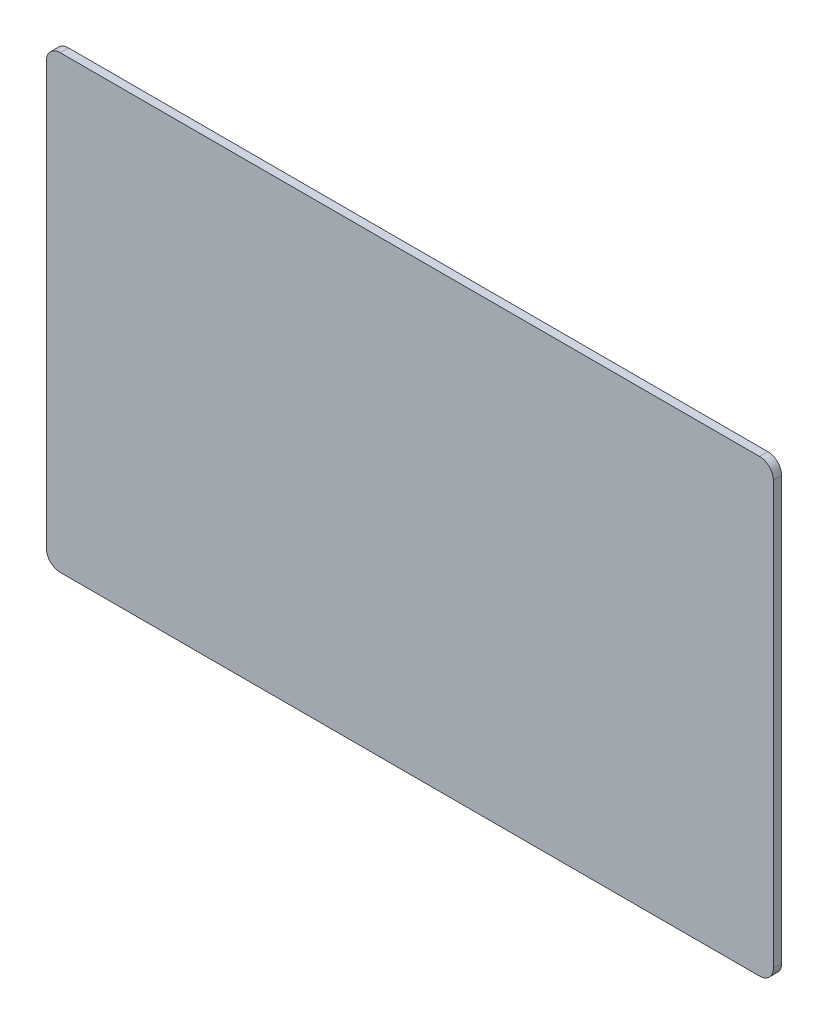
ISO-10303-21;
HEADER;
FILE_DESCRIPTION(('STEP AP214'),'2;1');
FILE_NAME('part.step','',(''),(''),'','','');
FILE_SCHEMA(('AUTOMOTIVE_DESIGN { 1 0 10303 214 1 1 1 1 }'));
ENDSEC;
DATA;
#1=APPLICATION_CONTEXT('core data for automotive mechanical design processes');
#2=APPLICATION_PROTOCOL_DEFINITION('international standard','automotive_design',2000,#1);
#3=PRODUCT_CONTEXT('',#1,'mechanical');
#4=PRODUCT('Part','Part','',(#3));
#5=PRODUCT_RELATED_PRODUCT_CATEGORY('part','',(#4));
#6=PRODUCT_DEFINITION_FORMATION('','',#4);
#7=PRODUCT_DEFINITION_CONTEXT('part definition',#1,'design');
#8=PRODUCT_DEFINITION('design','',#6,#7);
#9=PRODUCT_DEFINITION_SHAPE('','',#8);
#10=(LENGTH_UNIT() NAMED_UNIT(*) SI_UNIT(.MILLI.,.METRE.));
#11=(NAMED_UNIT(*) PLANE_ANGLE_UNIT() SI_UNIT($,.RADIAN.));
#12=(NAMED_UNIT(*) SI_UNIT($,.STERADIAN.) SOLID_ANGLE_UNIT());
#13=UNCERTAINTY_MEASURE_WITH_UNIT(LENGTH_MEASURE(1.E-05),#10,'distance_accuracy_value','');
#14=(GEOMETRIC_REPRESENTATION_CONTEXT(3) GLOBAL_UNCERTAINTY_ASSIGNED_CONTEXT((#13)) GLOBAL_UNIT_ASSIGNED_CONTEXT((#10,
#11,#12)) REPRESENTATION_CONTEXT('',''));
#15=CARTESIAN_POINT('',(0.,0.,0.));
#16=DIRECTION('',(0.,0.,1.));
#17=DIRECTION('',(1.,0.,0.));
#18=AXIS2_PLACEMENT_3D('',#15,#16,#17);
#19=CARTESIAN_POINT('',(0.,0.,0.));
#20=DIRECTION('',(0.,0.,-1.));
#21=DIRECTION('',(-1.,0.,0.));
#22=AXIS2_PLACEMENT_3D('',#19,#20,#21);
#23=PLANE('',#22);
#24=DIRECTION('',(-1.,0.,0.));
#25=VECTOR('',#24,1.);
#26=CARTESIAN_POINT('',(-52.5,32.5,0.));
#27=LINE('',#26,#25);
#28=CARTESIAN_POINT('',(50.5,32.5,0.));
#29=VERTEX_POINT('',#28);
#30=CARTESIAN_POINT('',(-50.5,32.5,0.));
#31=VERTEX_POINT('',#30);
#32=EDGE_CURVE('E175',#29,#31,#27,.T.);
#33=ORIENTED_EDGE('',*,*,#32,.F.);
#34=CARTESIAN_POINT('',(50.5,30.5,0.));
#35=DIRECTION('',(0.,0.,-1.));
#36=DIRECTION('',(-1.,0.,0.));
#37=AXIS2_PLACEMENT_3D('',#34,#35,#36);
#38=CIRCLE('',#37,2.);
#39=CARTESIAN_POINT('',(52.5,30.5,0.));
#40=VERTEX_POINT('',#39);
#41=EDGE_CURVE('E212',#29,#40,#38,.T.);
#42=ORIENTED_EDGE('',*,*,#41,.T.);
#43=DIRECTION('',(0.,1.,0.));
#44=VECTOR('',#43,1.);
#45=CARTESIAN_POINT('',(52.5,-32.5,0.));
#46=LINE('',#45,#44);
#47=CARTESIAN_POINT('',(52.5,-30.5,0.));
#48=VERTEX_POINT('',#47);
#49=EDGE_CURVE('E172',#48,#40,#46,.T.);
#50=ORIENTED_EDGE('',*,*,#49,.F.);
#51=CARTESIAN_POINT('',(50.5,-30.5,0.));
#52=DIRECTION('',(0.,0.,-1.));
#53=DIRECTION('',(-1.,0.,0.));
#54=AXIS2_PLACEMENT_3D('',#51,#52,#53);
#55=CIRCLE('',#54,2.);
#56=CARTESIAN_POINT('',(50.5,-32.5,0.));
#57=VERTEX_POINT('',#56);
#58=EDGE_CURVE('E206',#48,#57,#55,.T.);
#59=ORIENTED_EDGE('',*,*,#58,.T.);
#60=DIRECTION('',(1.,0.,0.));
#61=VECTOR('',#60,1.);
#62=CARTESIAN_POINT('',(-52.5,-32.5,0.));
#63=LINE('',#62,#61);
#64=CARTESIAN_POINT('',(-50.5,-32.5,0.));
#65=VERTEX_POINT('',#64);
#66=EDGE_CURVE('E185',#65,#57,#63,.T.);
#67=ORIENTED_EDGE('',*,*,#66,.F.);
#68=CARTESIAN_POINT('',(-50.5,-30.5,0.));
#69=DIRECTION('',(0.,0.,-1.));
#70=DIRECTION('',(-1.,0.,0.));
#71=AXIS2_PLACEMENT_3D('',#68,#69,#70);
#72=CIRCLE('',#71,2.);
#73=CARTESIAN_POINT('',(-52.5,-30.5,0.));
#74=VERTEX_POINT('',#73);
#75=EDGE_CURVE('E208',#65,#74,#72,.T.);
#76=ORIENTED_EDGE('',*,*,#75,.T.);
#77=DIRECTION('',(0.,-1.,0.));
#78=VECTOR('',#77,1.);
#79=CARTESIAN_POINT('',(-52.5,-32.5,0.));
#80=LINE('',#79,#78);
#81=CARTESIAN_POINT('',(-52.5,30.5,0.));
#82=VERTEX_POINT('',#81);
#83=EDGE_CURVE('E197',#82,#74,#80,.T.);
#84=ORIENTED_EDGE('',*,*,#83,.F.);
#85=CARTESIAN_POINT('',(-50.5,30.5,0.));
#86=DIRECTION('',(0.,0.,-1.));
#87=DIRECTION('',(-1.,0.,0.));
#88=AXIS2_PLACEMENT_3D('',#85,#86,#87);
#89=CIRCLE('',#88,2.);
#90=EDGE_CURVE('E210',#82,#31,#89,.T.);
#91=ORIENTED_EDGE('',*,*,#90,.T.);
#92=EDGE_LOOP('',(#33,#42,#50,#59,#67,#76,#84,#91));
#93=FACE_BOUND('',#92,.T.);
#94=DIRECTION('',(-1.,0.,0.));
#95=VECTOR('',#94,1.);
#96=CARTESIAN_POINT('',(0.,21.5,0.));
#97=LINE('',#96,#95);
#98=CARTESIAN_POINT('',(25.5,21.5,0.));
#99=VERTEX_POINT('',#98);
#100=CARTESIAN_POINT('',(-25.5,21.5,0.));
#101=VERTEX_POINT('',#100);
#102=EDGE_CURVE('E245',#99,#101,#97,.T.);
#103=ORIENTED_EDGE('',*,*,#102,.T.);
#104=DIRECTION('',(0.,-1.,0.));
#105=VECTOR('',#104,1.);
#106=CARTESIAN_POINT('',(-25.5,0.,0.));
#107=LINE('',#106,#105);
#108=CARTESIAN_POINT('',(-25.5,-10.5,0.));
#109=VERTEX_POINT('',#108);
#110=EDGE_CURVE('E249',#101,#109,#107,.T.);
#111=ORIENTED_EDGE('',*,*,#110,.T.);
#112=DIRECTION('',(1.,0.,0.));
#113=VECTOR('',#112,1.);
#114=CARTESIAN_POINT('',(0.,-10.5,0.));
#115=LINE('',#114,#113);
#116=CARTESIAN_POINT('',(25.5,-10.5,0.));
#117=VERTEX_POINT('',#116);
#118=EDGE_CURVE('E237',#109,#117,#115,.T.);
#119=ORIENTED_EDGE('',*,*,#118,.T.);
#120=DIRECTION('',(0.,1.,0.));
#121=VECTOR('',#120,1.);
#122=CARTESIAN_POINT('',(25.5,0.,0.));
#123=LINE('',#122,#121);
#124=EDGE_CURVE('E241',#117,#99,#123,.T.);
#125=ORIENTED_EDGE('',*,*,#124,.T.);
#126=EDGE_LOOP('',(#103,#111,#119,#125));
#127=FACE_BOUND('',#126,.T.);
#128=DIRECTION('',(1.,0.,0.));
#129=VECTOR('',#128,1.);
#130=CARTESIAN_POINT('',(5.49999999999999,-22.6,0.));
#131=LINE('',#130,#129);
#132=CARTESIAN_POINT('',(-5.50000000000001,-22.6,0.));
#133=VERTEX_POINT('',#132);
#134=CARTESIAN_POINT('',(5.49999999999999,-22.6,0.));
#135=VERTEX_POINT('',#134);
#136=EDGE_CURVE('E294',#133,#135,#131,.T.);
#137=ORIENTED_EDGE('',*,*,#136,.F.);
#138=DIRECTION('',(0.,1.,0.));
#139=VECTOR('',#138,1.);
#140=CARTESIAN_POINT('',(-5.50000000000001,-27.8,0.));
#141=LINE('',#140,#139);
#142=CARTESIAN_POINT('',(-5.50000000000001,-27.8,0.));
#143=VERTEX_POINT('',#142);
#144=EDGE_CURVE('E170',#143,#133,#141,.T.);
#145=ORIENTED_EDGE('',*,*,#144,.F.);
#146=DIRECTION('',(-1.,0.,0.));
#147=VECTOR('',#146,1.);
#148=CARTESIAN_POINT('',(5.49999999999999,-27.8,0.));
#149=LINE('',#148,#147);
#150=CARTESIAN_POINT('',(5.49999999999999,-27.8,0.));
#151=VERTEX_POINT('',#150);
#152=EDGE_CURVE('E166',#151,#143,#149,.T.);
#153=ORIENTED_EDGE('',*,*,#152,.F.);
#154=DIRECTION('',(0.,-1.,0.));
#155=VECTOR('',#154,1.);
#156=CARTESIAN_POINT('',(5.49999999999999,-27.8,0.));
#157=LINE('',#156,#155);
#158=EDGE_CURVE('E297',#135,#151,#157,.T.);
#159=ORIENTED_EDGE('',*,*,#158,.F.);
#160=EDGE_LOOP('',(#137,#145,#153,#159));
#161=FACE_BOUND('',#160,.T.);
#162=DIRECTION('',(-1.,0.,0.));
#163=VECTOR('',#162,1.);
#164=CARTESIAN_POINT('',(0.,21.5,0.));
#165=LINE('',#164,#163);
#166=CARTESIAN_POINT('',(45.2,21.5,0.));
#167=VERTEX_POINT('',#166);
#168=CARTESIAN_POINT('',(40.2,21.5,0.));
#169=VERTEX_POINT('',#168);
#170=EDGE_CURVE('E47',#167,#169,#165,.T.);
#171=ORIENTED_EDGE('',*,*,#170,.T.);
#172=DIRECTION('',(0.,-1.,0.));
#173=VECTOR('',#172,1.);
#174=CARTESIAN_POINT('',(40.2,0.,0.));
#175=LINE('',#174,#173);
#176=CARTESIAN_POINT('',(40.2,8.5,0.));
#177=VERTEX_POINT('',#176);
#178=EDGE_CURVE('E11',#169,#177,#175,.T.);
#179=ORIENTED_EDGE('',*,*,#178,.T.);
#180=DIRECTION('',(1.,0.,0.));
#181=VECTOR('',#180,1.);
#182=CARTESIAN_POINT('',(0.,8.50000000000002,0.));
#183=LINE('',#182,#181);
#184=CARTESIAN_POINT('',(45.2,8.5,0.));
#185=VERTEX_POINT('',#184);
#186=EDGE_CURVE('E252',#177,#185,#183,.T.);
#187=ORIENTED_EDGE('',*,*,#186,.T.);
#188=DIRECTION('',(0.,1.,0.));
#189=VECTOR('',#188,1.);
#190=CARTESIAN_POINT('',(45.2,0.,0.));
#191=LINE('',#190,#189);
#192=EDGE_CURVE('E256',#185,#167,#191,.T.);
#193=ORIENTED_EDGE('',*,*,#192,.T.);
#194=EDGE_LOOP('',(#171,#179,#187,#193));
#195=FACE_BOUND('',#194,.T.);
#196=ADVANCED_FACE('F38',(#93,#127,#161,#195),#23,.T.);
#197=ORIENTED_EDGE('',*,*,#178,.F.);
#198=ORIENTED_EDGE('',*,*,#170,.F.);
#199=ORIENTED_EDGE('',*,*,#192,.F.);
#200=ORIENTED_EDGE('',*,*,#186,.F.);
#201=EDGE_LOOP('',(#197,#198,#199,#200));
#202=FACE_BOUND('',#201,.T.);
#203=ADVANCED_FACE('F262',(#202),#23,.T.);
#204=CARTESIAN_POINT('',(52.5,-32.5,1.2));
#205=DIRECTION('',(-1.,0.,0.));
#206=DIRECTION('',(0.,0.,1.));
#207=AXIS2_PLACEMENT_3D('',#204,#205,#206);
#208=PLANE('',#207);
#209=ORIENTED_EDGE('',*,*,#49,.T.);
#210=DIRECTION('',(0.,0.,-1.));
#211=VECTOR('',#210,1.);
#212=CARTESIAN_POINT('',(52.5,30.5,1.2));
#213=LINE('',#212,#211);
#214=CARTESIAN_POINT('',(52.5,30.5,1.2));
#215=VERTEX_POINT('',#214);
#216=EDGE_CURVE('E217',#40,#215,#213,.F.);
#217=ORIENTED_EDGE('',*,*,#216,.T.);
#218=DIRECTION('',(0.,1.,0.));
#219=VECTOR('',#218,1.);
#220=CARTESIAN_POINT('',(52.5,-32.5,1.2));
#221=LINE('',#220,#219);
#222=CARTESIAN_POINT('',(52.5,-30.5,1.2));
#223=VERTEX_POINT('',#222);
#224=EDGE_CURVE('E181',#223,#215,#221,.T.);
#225=ORIENTED_EDGE('',*,*,#224,.F.);
#226=DIRECTION('',(0.,0.,-1.));
#227=VECTOR('',#226,1.);
#228=CARTESIAN_POINT('',(52.5,-30.5,1.2));
#229=LINE('',#228,#227);
#230=EDGE_CURVE('E214',#223,#48,#229,.T.);
#231=ORIENTED_EDGE('',*,*,#230,.T.);
#232=EDGE_LOOP('',(#209,#217,#225,#231));
#233=FACE_BOUND('',#232,.T.);
#234=ADVANCED_FACE('F264',(#233),#208,.F.);
#235=CARTESIAN_POINT('',(-52.5,32.5,1.2));
#236=DIRECTION('',(0.,-1.,0.));
#237=DIRECTION('',(0.,0.,-1.));
#238=AXIS2_PLACEMENT_3D('',#235,#236,#237);
#239=PLANE('',#238);
#240=DIRECTION('',(-1.,0.,0.));
#241=VECTOR('',#240,1.);
#242=CARTESIAN_POINT('',(-52.5,32.5,1.2));
#243=LINE('',#242,#241);
#244=CARTESIAN_POINT('',(50.5,32.5,1.2));
#245=VERTEX_POINT('',#244);
#246=CARTESIAN_POINT('',(-50.5,32.5,1.2));
#247=VERTEX_POINT('',#246);
#248=EDGE_CURVE('E184',#245,#247,#243,.T.);
#249=ORIENTED_EDGE('',*,*,#248,.F.);
#250=DIRECTION('',(0.,0.,-1.));
#251=VECTOR('',#250,1.);
#252=CARTESIAN_POINT('',(50.5,32.5,1.2));
#253=LINE('',#252,#251);
#254=EDGE_CURVE('E203',#245,#29,#253,.T.);
#255=ORIENTED_EDGE('',*,*,#254,.T.);
#256=ORIENTED_EDGE('',*,*,#32,.T.);
#257=DIRECTION('',(0.,0.,-1.));
#258=VECTOR('',#257,1.);
#259=CARTESIAN_POINT('',(-50.5,32.5,1.2));
#260=LINE('',#259,#258);
#261=EDGE_CURVE('E193',#31,#247,#260,.F.);
#262=ORIENTED_EDGE('',*,*,#261,.T.);
#263=EDGE_LOOP('',(#249,#255,#256,#262));
#264=FACE_BOUND('',#263,.T.);
#265=ADVANCED_FACE('F271',(#264),#239,.F.);
#266=CARTESIAN_POINT('',(-52.5,-32.5,1.2));
#267=DIRECTION('',(1.,0.,0.));
#268=DIRECTION('',(0.,0.,-1.));
#269=AXIS2_PLACEMENT_3D('',#266,#267,#268);
#270=PLANE('',#269);
#271=DIRECTION('',(0.,-1.,0.));
#272=VECTOR('',#271,1.);
#273=CARTESIAN_POINT('',(-52.5,-32.5,1.2));
#274=LINE('',#273,#272);
#275=CARTESIAN_POINT('',(-52.5,30.5,1.2));
#276=VERTEX_POINT('',#275);
#277=CARTESIAN_POINT('',(-52.5,-30.5,1.2));
#278=VERTEX_POINT('',#277);
#279=EDGE_CURVE('E188',#276,#278,#274,.T.);
#280=ORIENTED_EDGE('',*,*,#279,.F.);
#281=DIRECTION('',(0.,0.,-1.));
#282=VECTOR('',#281,1.);
#283=CARTESIAN_POINT('',(-52.5,30.5,1.2));
#284=LINE('',#283,#282);
#285=EDGE_CURVE('E229',#276,#82,#284,.T.);
#286=ORIENTED_EDGE('',*,*,#285,.T.);
#287=ORIENTED_EDGE('',*,*,#83,.T.);
#288=DIRECTION('',(0.,0.,-1.));
#289=VECTOR('',#288,1.);
#290=CARTESIAN_POINT('',(-52.5,-30.5,1.2));
#291=LINE('',#290,#289);
#292=EDGE_CURVE('E227',#74,#278,#291,.F.);
#293=ORIENTED_EDGE('',*,*,#292,.T.);
#294=EDGE_LOOP('',(#280,#286,#287,#293));
#295=FACE_BOUND('',#294,.T.);
#296=ADVANCED_FACE('F350',(#295),#270,.F.);
#297=CARTESIAN_POINT('',(-52.5,-32.5,1.2));
#298=DIRECTION('',(0.,1.,0.));
#299=DIRECTION('',(0.,0.,1.));
#300=AXIS2_PLACEMENT_3D('',#297,#298,#299);
#301=PLANE('',#300);
#302=DIRECTION('',(1.,0.,0.));
#303=VECTOR('',#302,1.);
#304=CARTESIAN_POINT('',(-52.5,-32.5,1.2));
#305=LINE('',#304,#303);
#306=CARTESIAN_POINT('',(-50.5,-32.5,1.2));
#307=VERTEX_POINT('',#306);
#308=CARTESIAN_POINT('',(50.5,-32.5,1.2));
#309=VERTEX_POINT('',#308);
#310=EDGE_CURVE('E191',#307,#309,#305,.T.);
#311=ORIENTED_EDGE('',*,*,#310,.F.);
#312=DIRECTION('',(0.,0.,-1.));
#313=VECTOR('',#312,1.);
#314=CARTESIAN_POINT('',(-50.5,-32.5,1.2));
#315=LINE('',#314,#313);
#316=EDGE_CURVE('E234',#307,#65,#315,.T.);
#317=ORIENTED_EDGE('',*,*,#316,.T.);
#318=ORIENTED_EDGE('',*,*,#66,.T.);
#319=DIRECTION('',(0.,0.,-1.));
#320=VECTOR('',#319,1.);
#321=CARTESIAN_POINT('',(50.5,-32.5,1.2));
#322=LINE('',#321,#320);
#323=EDGE_CURVE('E232',#57,#309,#322,.F.);
#324=ORIENTED_EDGE('',*,*,#323,.T.);
#325=EDGE_LOOP('',(#311,#317,#318,#324));
#326=FACE_BOUND('',#325,.T.);
#327=ADVANCED_FACE('F288',(#326),#301,.F.);
#328=CARTESIAN_POINT('',(0.,0.,1.2));
#329=DIRECTION('',(0.,0.,-1.));
#330=DIRECTION('',(-1.,0.,0.));
#331=AXIS2_PLACEMENT_3D('',#328,#329,#330);
#332=PLANE('',#331);
#333=ORIENTED_EDGE('',*,*,#224,.T.);
#334=CARTESIAN_POINT('',(50.5,30.5,1.2));
#335=DIRECTION('',(0.,0.,-1.));
#336=DIRECTION('',(-1.,0.,0.));
#337=AXIS2_PLACEMENT_3D('',#334,#335,#336);
#338=CIRCLE('',#337,2.);
#339=EDGE_CURVE('E225',#215,#245,#338,.F.);
#340=ORIENTED_EDGE('',*,*,#339,.T.);
#341=ORIENTED_EDGE('',*,*,#248,.T.);
#342=CARTESIAN_POINT('',(-50.5,30.5,1.2));
#343=DIRECTION('',(0.,0.,-1.));
#344=DIRECTION('',(-1.,0.,0.));
#345=AXIS2_PLACEMENT_3D('',#342,#343,#344);
#346=CIRCLE('',#345,2.);
#347=EDGE_CURVE('E223',#247,#276,#346,.F.);
#348=ORIENTED_EDGE('',*,*,#347,.T.);
#349=ORIENTED_EDGE('',*,*,#279,.T.);
#350=CARTESIAN_POINT('',(-50.5,-30.5,1.2));
#351=DIRECTION('',(0.,0.,-1.));
#352=DIRECTION('',(-1.,0.,0.));
#353=AXIS2_PLACEMENT_3D('',#350,#351,#352);
#354=CIRCLE('',#353,2.);
#355=EDGE_CURVE('E221',#278,#307,#354,.F.);
#356=ORIENTED_EDGE('',*,*,#355,.T.);
#357=ORIENTED_EDGE('',*,*,#310,.T.);
#358=CARTESIAN_POINT('',(50.5,-30.5,1.2));
#359=DIRECTION('',(0.,0.,-1.));
#360=DIRECTION('',(-1.,0.,0.));
#361=AXIS2_PLACEMENT_3D('',#358,#359,#360);
#362=CIRCLE('',#361,2.);
#363=EDGE_CURVE('E219',#309,#223,#362,.F.);
#364=ORIENTED_EDGE('',*,*,#363,.T.);
#365=EDGE_LOOP('',(#333,#340,#341,#348,#349,#356,#357,#364));
#366=FACE_BOUND('',#365,.T.);
#367=ADVANCED_FACE('F279',(#366),#332,.F.);
#368=ORIENTED_EDGE('',*,*,#110,.F.);
#369=ORIENTED_EDGE('',*,*,#102,.F.);
#370=ORIENTED_EDGE('',*,*,#124,.F.);
#371=ORIENTED_EDGE('',*,*,#118,.F.);
#372=EDGE_LOOP('',(#368,#369,#370,#371));
#373=FACE_BOUND('',#372,.T.);
#374=ADVANCED_FACE('F266',(#373),#23,.T.);
#375=CARTESIAN_POINT('',(50.5,30.5,1.2));
#376=DIRECTION('',(0.,0.,-1.));
#377=DIRECTION('',(-1.,0.,0.));
#378=AXIS2_PLACEMENT_3D('',#375,#376,#377);
#379=CYLINDRICAL_SURFACE('',#378,2.);
#380=ORIENTED_EDGE('',*,*,#339,.F.);
#381=ORIENTED_EDGE('',*,*,#216,.F.);
#382=ORIENTED_EDGE('',*,*,#41,.F.);
#383=ORIENTED_EDGE('',*,*,#254,.F.);
#384=EDGE_LOOP('',(#380,#381,#382,#383));
#385=FACE_BOUND('',#384,.T.);
#386=ADVANCED_FACE('F278',(#385),#379,.T.);
#387=CARTESIAN_POINT('',(-50.5,30.5,1.2));
#388=DIRECTION('',(0.,0.,-1.));
#389=DIRECTION('',(-1.,0.,0.));
#390=AXIS2_PLACEMENT_3D('',#387,#388,#389);
#391=CYLINDRICAL_SURFACE('',#390,2.);
#392=ORIENTED_EDGE('',*,*,#347,.F.);
#393=ORIENTED_EDGE('',*,*,#261,.F.);
#394=ORIENTED_EDGE('',*,*,#90,.F.);
#395=ORIENTED_EDGE('',*,*,#285,.F.);
#396=EDGE_LOOP('',(#392,#393,#394,#395));
#397=FACE_BOUND('',#396,.T.);
#398=ADVANCED_FACE('F285',(#397),#391,.T.);
#399=CARTESIAN_POINT('',(-50.5,-30.5,1.2));
#400=DIRECTION('',(0.,0.,-1.));
#401=DIRECTION('',(-1.,0.,0.));
#402=AXIS2_PLACEMENT_3D('',#399,#400,#401);
#403=CYLINDRICAL_SURFACE('',#402,2.);
#404=ORIENTED_EDGE('',*,*,#355,.F.);
#405=ORIENTED_EDGE('',*,*,#292,.F.);
#406=ORIENTED_EDGE('',*,*,#75,.F.);
#407=ORIENTED_EDGE('',*,*,#316,.F.);
#408=EDGE_LOOP('',(#404,#405,#406,#407));
#409=FACE_BOUND('',#408,.T.);
#410=ADVANCED_FACE('F325',(#409),#403,.T.);
#411=CARTESIAN_POINT('',(50.5,-30.5,1.2));
#412=DIRECTION('',(0.,0.,-1.));
#413=DIRECTION('',(-1.,0.,0.));
#414=AXIS2_PLACEMENT_3D('',#411,#412,#413);
#415=CYLINDRICAL_SURFACE('',#414,2.);
#416=ORIENTED_EDGE('',*,*,#363,.F.);
#417=ORIENTED_EDGE('',*,*,#323,.F.);
#418=ORIENTED_EDGE('',*,*,#58,.F.);
#419=ORIENTED_EDGE('',*,*,#230,.F.);
#420=EDGE_LOOP('',(#416,#417,#418,#419));
#421=FACE_BOUND('',#420,.T.);
#422=ADVANCED_FACE('F40',(#421),#415,.T.);
#423=CARTESIAN_POINT('',(-5.50000000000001,-27.8,-1.6));
#424=DIRECTION('',(1.,0.,0.));
#425=DIRECTION('',(0.,0.,-1.));
#426=AXIS2_PLACEMENT_3D('',#423,#424,#425);
#427=PLANE('',#426);
#428=ORIENTED_EDGE('',*,*,#144,.T.);
#429=DIRECTION('',(0.,0.,1.));
#430=VECTOR('',#429,1.);
#431=CARTESIAN_POINT('',(-5.50000000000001,-22.6,-1.6));
#432=LINE('',#431,#430);
#433=CARTESIAN_POINT('',(-5.50000000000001,-22.6,-1.6));
#434=VERTEX_POINT('',#433);
#435=EDGE_CURVE('E150',#434,#133,#432,.T.);
#436=ORIENTED_EDGE('',*,*,#435,.F.);
#437=DIRECTION('',(0.,1.,0.));
#438=VECTOR('',#437,1.);
#439=CARTESIAN_POINT('',(-5.50000000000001,-27.8,-1.6));
#440=LINE('',#439,#438);
#441=CARTESIAN_POINT('',(-5.50000000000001,-27.8,-1.6));
#442=VERTEX_POINT('',#441);
#443=EDGE_CURVE('E157',#442,#434,#440,.T.);
#444=ORIENTED_EDGE('',*,*,#443,.F.);
#445=DIRECTION('',(0.,0.,1.));
#446=VECTOR('',#445,1.);
#447=CARTESIAN_POINT('',(-5.50000000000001,-27.8,-1.6));
#448=LINE('',#447,#446);
#449=EDGE_CURVE('E304',#442,#143,#448,.T.);
#450=ORIENTED_EDGE('',*,*,#449,.T.);
#451=EDGE_LOOP('',(#428,#436,#444,#450));
#452=FACE_BOUND('',#451,.T.);
#453=ADVANCED_FACE('F168',(#452),#427,.F.);
#454=CARTESIAN_POINT('',(5.49999999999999,-22.6,-1.6));
#455=DIRECTION('',(0.,-1.,0.));
#456=DIRECTION('',(0.,0.,-1.));
#457=AXIS2_PLACEMENT_3D('',#454,#455,#456);
#458=PLANE('',#457);
#459=ORIENTED_EDGE('',*,*,#136,.T.);
#460=DIRECTION('',(0.,0.,1.));
#461=VECTOR('',#460,1.);
#462=CARTESIAN_POINT('',(5.49999999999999,-22.6,-1.6));
#463=LINE('',#462,#461);
#464=CARTESIAN_POINT('',(5.49999999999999,-22.6,-1.6));
#465=VERTEX_POINT('',#464);
#466=EDGE_CURVE('E153',#465,#135,#463,.T.);
#467=ORIENTED_EDGE('',*,*,#466,.F.);
#468=DIRECTION('',(1.,0.,0.));
#469=VECTOR('',#468,1.);
#470=CARTESIAN_POINT('',(5.49999999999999,-22.6,-1.6));
#471=LINE('',#470,#469);
#472=EDGE_CURVE('E146',#434,#465,#471,.T.);
#473=ORIENTED_EDGE('',*,*,#472,.F.);
#474=ORIENTED_EDGE('',*,*,#435,.T.);
#475=EDGE_LOOP('',(#459,#467,#473,#474));
#476=FACE_BOUND('',#475,.T.);
#477=ADVANCED_FACE('F148',(#476),#458,.F.);
#478=CARTESIAN_POINT('',(5.49999999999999,-27.8,-1.6));
#479=DIRECTION('',(-1.,0.,0.));
#480=DIRECTION('',(0.,0.,1.));
#481=AXIS2_PLACEMENT_3D('',#478,#479,#480);
#482=PLANE('',#481);
#483=ORIENTED_EDGE('',*,*,#158,.T.);
#484=DIRECTION('',(0.,0.,1.));
#485=VECTOR('',#484,1.);
#486=CARTESIAN_POINT('',(5.49999999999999,-27.8,-1.6));
#487=LINE('',#486,#485);
#488=CARTESIAN_POINT('',(5.49999999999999,-27.8,-1.6));
#489=VERTEX_POINT('',#488);
#490=EDGE_CURVE('E177',#489,#151,#487,.T.);
#491=ORIENTED_EDGE('',*,*,#490,.F.);
#492=DIRECTION('',(0.,-1.,0.));
#493=VECTOR('',#492,1.);
#494=CARTESIAN_POINT('',(5.49999999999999,-27.8,-1.6));
#495=LINE('',#494,#493);
#496=EDGE_CURVE('E156',#465,#489,#495,.T.);
#497=ORIENTED_EDGE('',*,*,#496,.F.);
#498=ORIENTED_EDGE('',*,*,#466,.T.);
#499=EDGE_LOOP('',(#483,#491,#497,#498));
#500=FACE_BOUND('',#499,.T.);
#501=ADVANCED_FACE('F309',(#500),#482,.F.);
#502=CARTESIAN_POINT('',(5.49999999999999,-27.8,-1.6));
#503=DIRECTION('',(0.,1.,0.));
#504=DIRECTION('',(0.,0.,1.));
#505=AXIS2_PLACEMENT_3D('',#502,#503,#504);
#506=PLANE('',#505);
#507=ORIENTED_EDGE('',*,*,#152,.T.);
#508=ORIENTED_EDGE('',*,*,#449,.F.);
#509=DIRECTION('',(-1.,0.,0.));
#510=VECTOR('',#509,1.);
#511=CARTESIAN_POINT('',(5.49999999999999,-27.8,-1.6));
#512=LINE('',#511,#510);
#513=EDGE_CURVE('E162',#489,#442,#512,.T.);
#514=ORIENTED_EDGE('',*,*,#513,.F.);
#515=ORIENTED_EDGE('',*,*,#490,.T.);
#516=EDGE_LOOP('',(#507,#508,#514,#515));
#517=FACE_BOUND('',#516,.T.);
#518=ADVANCED_FACE('F307',(#517),#506,.F.);
#519=CARTESIAN_POINT('',(0.,0.,-1.6));
#520=DIRECTION('',(0.,0.,1.));
#521=DIRECTION('',(1.,0.,0.));
#522=AXIS2_PLACEMENT_3D('',#519,#520,#521);
#523=PLANE('',#522);
#524=ORIENTED_EDGE('',*,*,#443,.T.);
#525=ORIENTED_EDGE('',*,*,#472,.T.);
#526=ORIENTED_EDGE('',*,*,#496,.T.);
#527=ORIENTED_EDGE('',*,*,#513,.T.);
#528=EDGE_LOOP('',(#524,#525,#526,#527));
#529=FACE_BOUND('',#528,.T.);
#530=ADVANCED_FACE('F160',(#529),#523,.F.);
#531=CLOSED_SHELL('',(#196,#203,#234,#265,#296,#327,#367,#374,#386,#398,#410,#422,#453,#477,
#501,#518,#530));
#532=MANIFOLD_SOLID_BREP('B2',#531);
#533=ADVANCED_BREP_SHAPE_REPRESENTATION('',(#18,#532),#14);
#534=SHAPE_DEFINITION_REPRESENTATION(#9,#533);
ENDSEC;
END-ISO-10303-21;
